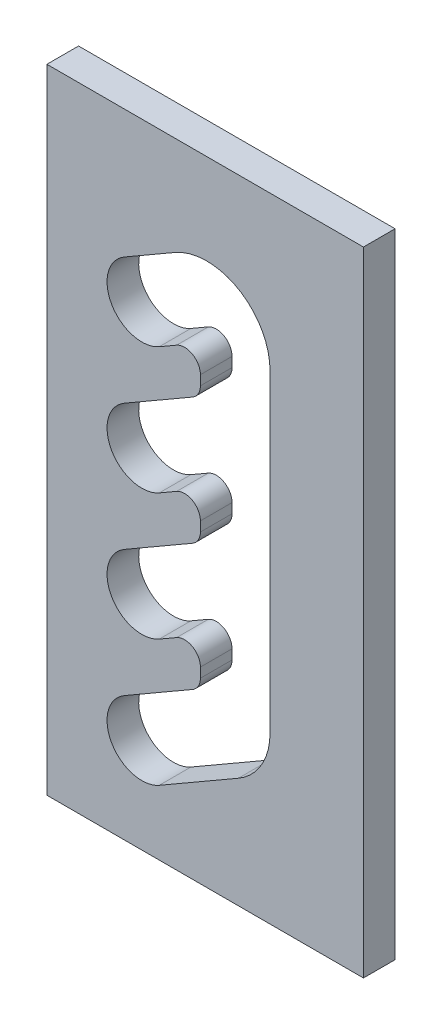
from build123d import *

# Parameters (mm, degrees)
SKIZZE1_W                       = 100
SKIZZE1_H                       = 200
AUFSATZ_LINEAR_AUSTRAGEN1_DEPTH = 10
SCHNITT_LINEAR_AUSTRAGEN1_DEPTH = 224.830292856
VERRUNDUNG1_R                   = 5
VERRUNDUNG2_R                   = 20


with BuildPart() as part:
    # Skizze1 → Aufsatz-Linear austragen1 (new body)
    with BuildSketch(Plane.XY):
        with Locations((50, 100)):
            Rectangle(SKIZZE1_W, SKIZZE1_H)
    extrude(amount=AUFSATZ_LINEAR_AUSTRAGEN1_DEPTH)

    # Skizze2 → Schnitt-Linear austragen1 (cut, through all)
    with BuildSketch(Plane.XY.offset(10)):
        with BuildLine():
            Line((24.5, 39.526279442), (48.490381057, 53.377132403))
            Line((48.490381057, 53.377132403), (48.490381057, 67.973720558))
            Line((48.490381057, 67.973720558), (35.5, 60.473720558))
            ThreePointArc((35.5, 60.473720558), (20.473720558, 64.5), (24.5, 79.526279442))
            Line((24.5, 79.526279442), (48.490381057, 93.377132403))
            Line((48.490381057, 93.377132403), (48.490381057, 107.973720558))
            Line((48.490381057, 107.973720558), (35.5, 100.473720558))
            ThreePointArc((35.5, 100.473720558), (20.473720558, 104.5), (24.5, 119.526279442))
            Line((24.5, 119.526279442), (48.490381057, 133.377132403))
            Line((48.490381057, 133.377132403), (48.490381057, 147.973720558))
            Line((48.490381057, 147.973720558), (35.5, 140.473720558))
            ThreePointArc((35.5, 140.473720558), (20.473720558, 144.5), (24.5, 159.526279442))
            Line((24.5, 159.526279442), (48.490381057, 173.377132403))
            Line((48.490381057, 173.377132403), (70.490381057, 186.078838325))
            Line((70.490381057, 186.078838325), (70.490381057, 40.675426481))
            Line((70.490381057, 40.675426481), (48.490381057, 27.973720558))
            Line((48.490381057, 27.973720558), (35.5, 20.473720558))
            ThreePointArc((35.5, 20.473720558), (20.473720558, 24.5), (24.5, 39.526279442))
        make_face()
    extrude(amount=-SCHNITT_LINEAR_AUSTRAGEN1_DEPTH, mode=Mode.SUBTRACT)

    # Verrundung1
    verrundung1_edges = [part.edges().sort_by_distance(p)[0] for p in [
        (48.490381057, 53.377132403, 5),
        (48.490381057, 67.973720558, 5),
        (48.490381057, 93.377132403, 5),
        (48.490381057, 107.973720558, 5),
        (48.490381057, 133.377132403, 5),
        (48.490381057, 147.973720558, 5),
    ]]
    fillet(verrundung1_edges, radius=VERRUNDUNG1_R)

    # Verrundung2
    verrundung2_edges = [part.edges().sort_by_distance(p)[0] for p in [
        (70.490381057, 186.078838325, 5),
        (70.490381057, 40.675426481, 5),
    ]]
    fillet(verrundung2_edges, radius=VERRUNDUNG2_R)


solid = part.part
